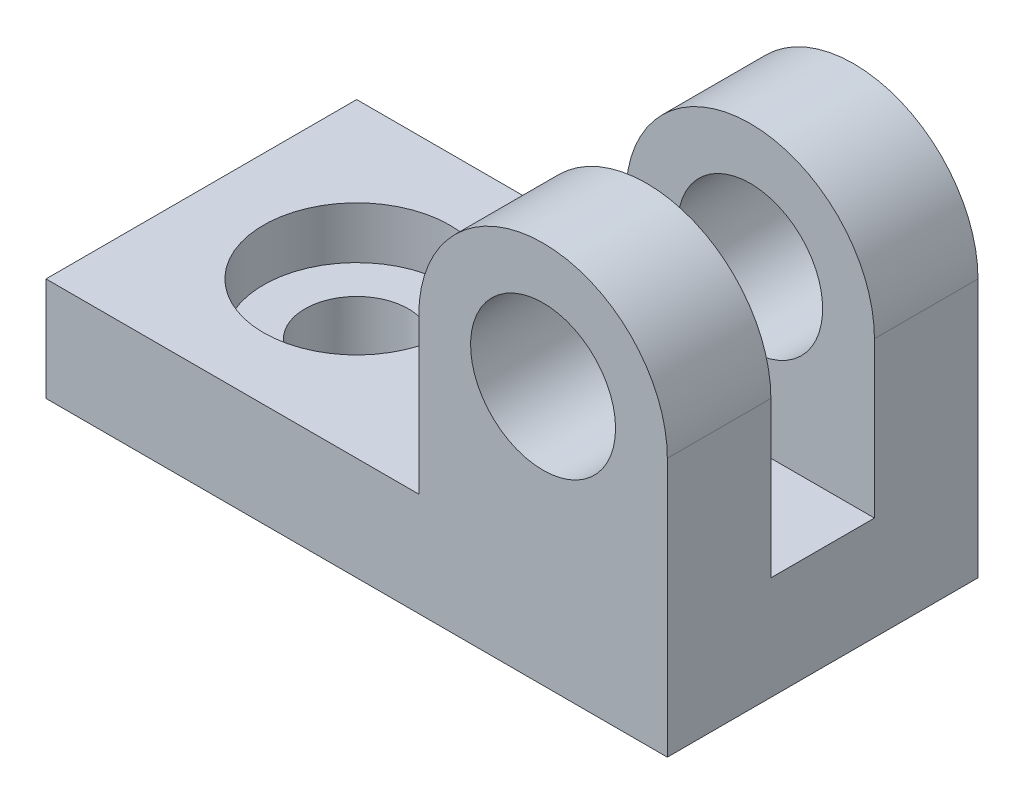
ISO-10303-21;
HEADER;
FILE_DESCRIPTION(('STEP AP214'),'2;1');
FILE_NAME('part.step','',(''),(''),'','','');
FILE_SCHEMA(('AUTOMOTIVE_DESIGN { 1 0 10303 214 1 1 1 1 }'));
ENDSEC;
DATA;
#1=APPLICATION_CONTEXT('core data for automotive mechanical design processes');
#2=APPLICATION_PROTOCOL_DEFINITION('international standard','automotive_design',2000,#1);
#3=PRODUCT_CONTEXT('',#1,'mechanical');
#4=PRODUCT('Part','Part','',(#3));
#5=PRODUCT_RELATED_PRODUCT_CATEGORY('part','',(#4));
#6=PRODUCT_DEFINITION_FORMATION('','',#4);
#7=PRODUCT_DEFINITION_CONTEXT('part definition',#1,'design');
#8=PRODUCT_DEFINITION('design','',#6,#7);
#9=PRODUCT_DEFINITION_SHAPE('','',#8);
#10=(LENGTH_UNIT() NAMED_UNIT(*) SI_UNIT(.MILLI.,.METRE.));
#11=(NAMED_UNIT(*) PLANE_ANGLE_UNIT() SI_UNIT($,.RADIAN.));
#12=(NAMED_UNIT(*) SI_UNIT($,.STERADIAN.) SOLID_ANGLE_UNIT());
#13=UNCERTAINTY_MEASURE_WITH_UNIT(LENGTH_MEASURE(1.E-05),#10,'distance_accuracy_value','');
#14=(GEOMETRIC_REPRESENTATION_CONTEXT(3) GLOBAL_UNCERTAINTY_ASSIGNED_CONTEXT((#13)) GLOBAL_UNIT_ASSIGNED_CONTEXT((#10,
#11,#12)) REPRESENTATION_CONTEXT('',''));
#15=CARTESIAN_POINT('',(0.,0.,0.));
#16=DIRECTION('',(0.,0.,1.));
#17=DIRECTION('',(1.,0.,0.));
#18=AXIS2_PLACEMENT_3D('',#15,#16,#17);
#19=CARTESIAN_POINT('',(-7.09558823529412,20.,15.));
#20=DIRECTION('',(0.,0.,-1.));
#21=DIRECTION('',(-1.,0.,0.));
#22=AXIS2_PLACEMENT_3D('',#19,#20,#21);
#23=CYLINDRICAL_SURFACE('',#22,12.);
#24=DIRECTION('',(0.,0.,-1.));
#25=VECTOR('',#24,1.);
#26=CARTESIAN_POINT('',(-19.0955882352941,20.,15.));
#27=LINE('',#26,#25);
#28=CARTESIAN_POINT('',(-19.0955882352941,20.,-5.));
#29=VERTEX_POINT('',#28);
#30=CARTESIAN_POINT('',(-19.0955882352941,20.,-15.));
#31=VERTEX_POINT('',#30);
#32=EDGE_CURVE('E158',#29,#31,#27,.T.);
#33=ORIENTED_EDGE('',*,*,#32,.F.);
#34=CARTESIAN_POINT('',(-7.09558823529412,20.,-5.));
#35=DIRECTION('',(0.,0.,-1.));
#36=DIRECTION('',(-1.,0.,0.));
#37=AXIS2_PLACEMENT_3D('',#34,#35,#36);
#38=CIRCLE('',#37,12.);
#39=CARTESIAN_POINT('',(4.90441176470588,20.,-5.));
#40=VERTEX_POINT('',#39);
#41=EDGE_CURVE('E138',#29,#40,#38,.T.);
#42=ORIENTED_EDGE('',*,*,#41,.T.);
#43=DIRECTION('',(0.,0.,-1.));
#44=VECTOR('',#43,1.);
#45=CARTESIAN_POINT('',(4.90441176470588,20.,15.));
#46=LINE('',#45,#44);
#47=CARTESIAN_POINT('',(4.90441176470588,20.,-15.));
#48=VERTEX_POINT('',#47);
#49=EDGE_CURVE('E221',#40,#48,#46,.T.);
#50=ORIENTED_EDGE('',*,*,#49,.T.);
#51=CARTESIAN_POINT('',(-7.09558823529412,20.,-15.));
#52=DIRECTION('',(0.,0.,1.));
#53=DIRECTION('',(1.,0.,0.));
#54=AXIS2_PLACEMENT_3D('',#51,#52,#53);
#55=CIRCLE('',#54,12.);
#56=EDGE_CURVE('E143',#48,#31,#55,.T.);
#57=ORIENTED_EDGE('',*,*,#56,.T.);
#58=EDGE_LOOP('',(#33,#42,#50,#57));
#59=FACE_BOUND('',#58,.T.);
#60=ADVANCED_FACE('F31',(#59),#23,.T.);
#61=CARTESIAN_POINT('',(-19.0955882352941,20.,15.));
#62=DIRECTION('',(1.,0.,0.));
#63=DIRECTION('',(0.,0.,-1.));
#64=AXIS2_PLACEMENT_3D('',#61,#62,#63);
#65=PLANE('',#64);
#66=DIRECTION('',(0.,0.,-1.));
#67=VECTOR('',#66,1.);
#68=CARTESIAN_POINT('',(-19.0955882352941,5.,15.));
#69=LINE('',#68,#67);
#70=CARTESIAN_POINT('',(-19.0955882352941,5.00000000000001,-5.));
#71=VERTEX_POINT('',#70);
#72=CARTESIAN_POINT('',(-19.0955882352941,5.,-15.));
#73=VERTEX_POINT('',#72);
#74=EDGE_CURVE('E35',#71,#73,#69,.T.);
#75=ORIENTED_EDGE('',*,*,#74,.F.);
#76=DIRECTION('',(0.,1.,0.));
#77=VECTOR('',#76,1.);
#78=CARTESIAN_POINT('',(-19.0955882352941,20.,-5.));
#79=LINE('',#78,#77);
#80=EDGE_CURVE('E172',#71,#29,#79,.T.);
#81=ORIENTED_EDGE('',*,*,#80,.T.);
#82=ORIENTED_EDGE('',*,*,#32,.T.);
#83=DIRECTION('',(0.,-1.,0.));
#84=VECTOR('',#83,1.);
#85=CARTESIAN_POINT('',(-19.0955882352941,20.,-15.));
#86=LINE('',#85,#84);
#87=EDGE_CURVE('E148',#31,#73,#86,.T.);
#88=ORIENTED_EDGE('',*,*,#87,.T.);
#89=EDGE_LOOP('',(#75,#81,#82,#88));
#90=FACE_BOUND('',#89,.T.);
#91=ADVANCED_FACE('F185',(#90),#65,.F.);
#92=CARTESIAN_POINT('',(-7.09558823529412,20.,15.));
#93=DIRECTION('',(0.,0.,-1.));
#94=DIRECTION('',(-1.,0.,0.));
#95=AXIS2_PLACEMENT_3D('',#92,#93,#94);
#96=CYLINDRICAL_SURFACE('',#95,7.);
#97=CARTESIAN_POINT('',(-7.09558823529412,20.,-5.));
#98=DIRECTION('',(0.,0.,-1.));
#99=DIRECTION('',(-1.,0.,0.));
#100=AXIS2_PLACEMENT_3D('',#97,#98,#99);
#101=CIRCLE('',#100,7.);
#102=CARTESIAN_POINT('',(-14.0955882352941,20.,-5.));
#103=VERTEX_POINT('',#102);
#104=EDGE_CURVE('E117',#103,#103,#101,.T.);
#105=ORIENTED_EDGE('',*,*,#104,.F.);
#106=EDGE_LOOP('',(#105));
#107=FACE_BOUND('',#106,.T.);
#108=CARTESIAN_POINT('',(-7.09558823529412,20.,-15.));
#109=DIRECTION('',(0.,0.,1.));
#110=DIRECTION('',(1.,0.,0.));
#111=AXIS2_PLACEMENT_3D('',#108,#109,#110);
#112=CIRCLE('',#111,7.);
#113=CARTESIAN_POINT('',(-0.0955882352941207,20.,-15.));
#114=VERTEX_POINT('',#113);
#115=EDGE_CURVE('E133',#114,#114,#112,.T.);
#116=ORIENTED_EDGE('',*,*,#115,.F.);
#117=EDGE_LOOP('',(#116));
#118=FACE_BOUND('',#117,.T.);
#119=ADVANCED_FACE('F268',(#107,#118),#96,.F.);
#120=CARTESIAN_POINT('',(-55.0955882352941,5.,15.));
#121=DIRECTION('',(0.,-1.,0.));
#122=DIRECTION('',(0.,0.,-1.));
#123=AXIS2_PLACEMENT_3D('',#120,#121,#122);
#124=PLANE('',#123);
#125=DIRECTION('',(1.,0.,0.));
#126=VECTOR('',#125,1.);
#127=CARTESIAN_POINT('',(-25.,5.00000000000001,-5.));
#128=LINE('',#127,#126);
#129=CARTESIAN_POINT('',(4.90441176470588,5.00000000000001,-5.));
#130=VERTEX_POINT('',#129);
#131=EDGE_CURVE('E127',#71,#130,#128,.T.);
#132=ORIENTED_EDGE('',*,*,#131,.F.);
#133=ORIENTED_EDGE('',*,*,#74,.T.);
#134=DIRECTION('',(-1.,0.,0.));
#135=VECTOR('',#134,1.);
#136=CARTESIAN_POINT('',(-55.0955882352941,5.,-15.));
#137=LINE('',#136,#135);
#138=CARTESIAN_POINT('',(-55.0955882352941,5.,-15.));
#139=VERTEX_POINT('',#138);
#140=EDGE_CURVE('E191',#73,#139,#137,.T.);
#141=ORIENTED_EDGE('',*,*,#140,.T.);
#142=DIRECTION('',(0.,0.,-1.));
#143=VECTOR('',#142,1.);
#144=CARTESIAN_POINT('',(-55.0955882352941,5.,15.));
#145=LINE('',#144,#143);
#146=CARTESIAN_POINT('',(-55.0955882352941,5.,15.));
#147=VERTEX_POINT('',#146);
#148=EDGE_CURVE('E212',#147,#139,#145,.T.);
#149=ORIENTED_EDGE('',*,*,#148,.F.);
#150=DIRECTION('',(-1.,0.,0.));
#151=VECTOR('',#150,1.);
#152=CARTESIAN_POINT('',(-55.0955882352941,5.,15.));
#153=LINE('',#152,#151);
#154=CARTESIAN_POINT('',(-19.0955882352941,5.,15.));
#155=VERTEX_POINT('',#154);
#156=EDGE_CURVE('E159',#155,#147,#153,.T.);
#157=ORIENTED_EDGE('',*,*,#156,.F.);
#158=CARTESIAN_POINT('',(-19.0955882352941,5.,5.));
#159=VERTEX_POINT('',#158);
#160=EDGE_CURVE('E126',#155,#159,#69,.T.);
#161=ORIENTED_EDGE('',*,*,#160,.T.);
#162=DIRECTION('',(1.,0.,0.));
#163=VECTOR('',#162,1.);
#164=CARTESIAN_POINT('',(-25.,5.00000000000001,5.));
#165=LINE('',#164,#163);
#166=CARTESIAN_POINT('',(4.90441176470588,5.00000000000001,5.));
#167=VERTEX_POINT('',#166);
#168=EDGE_CURVE('E49',#159,#167,#165,.T.);
#169=ORIENTED_EDGE('',*,*,#168,.T.);
#170=DIRECTION('',(0.,0.,1.));
#171=VECTOR('',#170,1.);
#172=CARTESIAN_POINT('',(4.90441176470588,5.00000000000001,15.));
#173=LINE('',#172,#171);
#174=EDGE_CURVE('E122',#130,#167,#173,.T.);
#175=ORIENTED_EDGE('',*,*,#174,.F.);
#176=EDGE_LOOP('',(#132,#133,#141,#149,#157,#161,#169,#175));
#177=FACE_BOUND('',#176,.T.);
#178=CARTESIAN_POINT('',(-40.0955882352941,5.,0.));
#179=DIRECTION('',(0.,-1.,0.));
#180=DIRECTION('',(0.,0.,-1.));
#181=AXIS2_PLACEMENT_3D('',#178,#179,#180);
#182=CIRCLE('',#181,9.);
#183=CARTESIAN_POINT('',(-40.0955882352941,5.,-9.));
#184=VERTEX_POINT('',#183);
#185=EDGE_CURVE('E228',#184,#184,#182,.T.);
#186=ORIENTED_EDGE('',*,*,#185,.T.);
#187=EDGE_LOOP('',(#186));
#188=FACE_BOUND('',#187,.T.);
#189=ADVANCED_FACE('F120',(#177,#188),#124,.F.);
#190=CARTESIAN_POINT('',(-40.0955882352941,-15.,0.));
#191=DIRECTION('',(0.,1.,0.));
#192=DIRECTION('',(0.,0.,1.));
#193=AXIS2_PLACEMENT_3D('',#190,#191,#192);
#194=CYLINDRICAL_SURFACE('',#193,5.);
#195=CARTESIAN_POINT('',(-40.0955882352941,-5.,0.));
#196=DIRECTION('',(0.,1.,0.));
#197=DIRECTION('',(-1.,0.,0.));
#198=AXIS2_PLACEMENT_3D('',#195,#196,#197);
#199=CIRCLE('',#198,5.);
#200=CARTESIAN_POINT('',(-45.0955882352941,-5.,0.));
#201=VERTEX_POINT('',#200);
#202=EDGE_CURVE('E231',#201,#201,#199,.T.);
#203=ORIENTED_EDGE('',*,*,#202,.F.);
#204=EDGE_LOOP('',(#203));
#205=FACE_BOUND('',#204,.T.);
#206=CARTESIAN_POINT('',(-40.0955882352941,0.,0.));
#207=DIRECTION('',(0.,1.,0.));
#208=DIRECTION('',(0.,0.,1.));
#209=AXIS2_PLACEMENT_3D('',#206,#207,#208);
#210=CIRCLE('',#209,5.);
#211=CARTESIAN_POINT('',(-40.0955882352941,0.,5.));
#212=VERTEX_POINT('',#211);
#213=EDGE_CURVE('E208',#212,#212,#210,.F.);
#214=ORIENTED_EDGE('',*,*,#213,.F.);
#215=EDGE_LOOP('',(#214));
#216=FACE_BOUND('',#215,.T.);
#217=ADVANCED_FACE('F302',(#205,#216),#194,.F.);
#218=CARTESIAN_POINT('',(-55.0955882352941,-5.,15.));
#219=DIRECTION('',(1.,0.,0.));
#220=DIRECTION('',(0.,0.,-1.));
#221=AXIS2_PLACEMENT_3D('',#218,#219,#220);
#222=PLANE('',#221);
#223=DIRECTION('',(0.,-1.,0.));
#224=VECTOR('',#223,1.);
#225=CARTESIAN_POINT('',(-55.0955882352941,-5.,-15.));
#226=LINE('',#225,#224);
#227=CARTESIAN_POINT('',(-55.0955882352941,-5.,-15.));
#228=VERTEX_POINT('',#227);
#229=EDGE_CURVE('E195',#139,#228,#226,.T.);
#230=ORIENTED_EDGE('',*,*,#229,.T.);
#231=DIRECTION('',(0.,0.,-1.));
#232=VECTOR('',#231,1.);
#233=CARTESIAN_POINT('',(-55.0955882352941,-5.,15.));
#234=LINE('',#233,#232);
#235=CARTESIAN_POINT('',(-55.0955882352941,-5.,15.));
#236=VERTEX_POINT('',#235);
#237=EDGE_CURVE('E11',#236,#228,#234,.T.);
#238=ORIENTED_EDGE('',*,*,#237,.F.);
#239=DIRECTION('',(0.,-1.,0.));
#240=VECTOR('',#239,1.);
#241=CARTESIAN_POINT('',(-55.0955882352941,-5.,15.));
#242=LINE('',#241,#240);
#243=EDGE_CURVE('E198',#147,#236,#242,.T.);
#244=ORIENTED_EDGE('',*,*,#243,.F.);
#245=ORIENTED_EDGE('',*,*,#148,.T.);
#246=EDGE_LOOP('',(#230,#238,#244,#245));
#247=FACE_BOUND('',#246,.T.);
#248=ADVANCED_FACE('F33',(#247),#222,.F.);
#249=CARTESIAN_POINT('',(4.90441176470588,-4.99999999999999,15.));
#250=DIRECTION('',(0.,1.,0.));
#251=DIRECTION('',(-1.,0.,0.));
#252=AXIS2_PLACEMENT_3D('',#249,#250,#251);
#253=PLANE('',#252);
#254=ORIENTED_EDGE('',*,*,#202,.T.);
#255=EDGE_LOOP('',(#254));
#256=FACE_BOUND('',#255,.T.);
#257=DIRECTION('',(1.,0.,0.));
#258=VECTOR('',#257,1.);
#259=CARTESIAN_POINT('',(4.90441176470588,-4.99999999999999,-15.));
#260=LINE('',#259,#258);
#261=CARTESIAN_POINT('',(4.90441176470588,-4.99999999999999,-15.));
#262=VERTEX_POINT('',#261);
#263=EDGE_CURVE('E204',#228,#262,#260,.T.);
#264=ORIENTED_EDGE('',*,*,#263,.T.);
#265=DIRECTION('',(0.,0.,-1.));
#266=VECTOR('',#265,1.);
#267=CARTESIAN_POINT('',(4.90441176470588,-4.99999999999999,15.));
#268=LINE('',#267,#266);
#269=CARTESIAN_POINT('',(4.90441176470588,-4.99999999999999,15.));
#270=VERTEX_POINT('',#269);
#271=EDGE_CURVE('E41',#270,#262,#268,.T.);
#272=ORIENTED_EDGE('',*,*,#271,.F.);
#273=DIRECTION('',(1.,0.,0.));
#274=VECTOR('',#273,1.);
#275=CARTESIAN_POINT('',(4.90441176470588,-4.99999999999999,15.));
#276=LINE('',#275,#274);
#277=EDGE_CURVE('E201',#236,#270,#276,.T.);
#278=ORIENTED_EDGE('',*,*,#277,.F.);
#279=ORIENTED_EDGE('',*,*,#237,.T.);
#280=EDGE_LOOP('',(#264,#272,#278,#279));
#281=FACE_BOUND('',#280,.T.);
#282=ADVANCED_FACE('F237',(#256,#281),#253,.F.);
#283=CARTESIAN_POINT('',(4.90441176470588,-4.99999999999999,15.));
#284=DIRECTION('',(-1.,0.,0.));
#285=DIRECTION('',(0.,0.,1.));
#286=AXIS2_PLACEMENT_3D('',#283,#284,#285);
#287=PLANE('',#286);
#288=ORIENTED_EDGE('',*,*,#49,.F.);
#289=DIRECTION('',(0.,-1.,0.));
#290=VECTOR('',#289,1.);
#291=CARTESIAN_POINT('',(4.90441176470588,-4.99999999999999,-5.));
#292=LINE('',#291,#290);
#293=EDGE_CURVE('E132',#40,#130,#292,.T.);
#294=ORIENTED_EDGE('',*,*,#293,.T.);
#295=ORIENTED_EDGE('',*,*,#174,.T.);
#296=DIRECTION('',(0.,1.,0.));
#297=VECTOR('',#296,1.);
#298=CARTESIAN_POINT('',(4.90441176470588,-4.99999999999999,5.));
#299=LINE('',#298,#297);
#300=CARTESIAN_POINT('',(4.90441176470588,20.,5.));
#301=VERTEX_POINT('',#300);
#302=EDGE_CURVE('E109',#167,#301,#299,.T.);
#303=ORIENTED_EDGE('',*,*,#302,.T.);
#304=CARTESIAN_POINT('',(4.90441176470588,20.,15.));
#305=VERTEX_POINT('',#304);
#306=EDGE_CURVE('E222',#305,#301,#46,.T.);
#307=ORIENTED_EDGE('',*,*,#306,.F.);
#308=DIRECTION('',(0.,1.,0.));
#309=VECTOR('',#308,1.);
#310=CARTESIAN_POINT('',(4.90441176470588,-4.99999999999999,15.));
#311=LINE('',#310,#309);
#312=EDGE_CURVE('E218',#270,#305,#311,.T.);
#313=ORIENTED_EDGE('',*,*,#312,.F.);
#314=ORIENTED_EDGE('',*,*,#271,.T.);
#315=DIRECTION('',(0.,1.,0.));
#316=VECTOR('',#315,1.);
#317=CARTESIAN_POINT('',(4.90441176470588,-4.99999999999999,-15.));
#318=LINE('',#317,#316);
#319=EDGE_CURVE('E199',#262,#48,#318,.T.);
#320=ORIENTED_EDGE('',*,*,#319,.T.);
#321=EDGE_LOOP('',(#288,#294,#295,#303,#307,#313,#314,#320));
#322=FACE_BOUND('',#321,.T.);
#323=ADVANCED_FACE('F131',(#322),#287,.F.);
#324=CARTESIAN_POINT('',(-55.0955882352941,5.,15.));
#325=DIRECTION('',(0.,0.,-1.));
#326=DIRECTION('',(-1.,0.,0.));
#327=AXIS2_PLACEMENT_3D('',#324,#325,#326);
#328=PLANE('',#327);
#329=ORIENTED_EDGE('',*,*,#243,.T.);
#330=ORIENTED_EDGE('',*,*,#277,.T.);
#331=ORIENTED_EDGE('',*,*,#312,.T.);
#332=CARTESIAN_POINT('',(-7.09558823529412,20.,15.));
#333=DIRECTION('',(0.,0.,1.));
#334=DIRECTION('',(1.,0.,0.));
#335=AXIS2_PLACEMENT_3D('',#332,#333,#334);
#336=CIRCLE('',#335,12.);
#337=CARTESIAN_POINT('',(-19.0955882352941,20.,15.));
#338=VERTEX_POINT('',#337);
#339=EDGE_CURVE('E145',#305,#338,#336,.T.);
#340=ORIENTED_EDGE('',*,*,#339,.T.);
#341=DIRECTION('',(0.,-1.,0.));
#342=VECTOR('',#341,1.);
#343=CARTESIAN_POINT('',(-19.0955882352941,20.,15.));
#344=LINE('',#343,#342);
#345=EDGE_CURVE('E147',#338,#155,#344,.T.);
#346=ORIENTED_EDGE('',*,*,#345,.T.);
#347=ORIENTED_EDGE('',*,*,#156,.T.);
#348=EDGE_LOOP('',(#329,#330,#331,#340,#346,#347));
#349=FACE_BOUND('',#348,.T.);
#350=CARTESIAN_POINT('',(-7.09558823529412,20.,15.));
#351=DIRECTION('',(0.,0.,1.));
#352=DIRECTION('',(1.,0.,0.));
#353=AXIS2_PLACEMENT_3D('',#350,#351,#352);
#354=CIRCLE('',#353,7.);
#355=CARTESIAN_POINT('',(-0.0955882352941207,20.,15.));
#356=VERTEX_POINT('',#355);
#357=EDGE_CURVE('E136',#356,#356,#354,.T.);
#358=ORIENTED_EDGE('',*,*,#357,.F.);
#359=EDGE_LOOP('',(#358));
#360=FACE_BOUND('',#359,.T.);
#361=ADVANCED_FACE('F242',(#349,#360),#328,.F.);
#362=CARTESIAN_POINT('',(-55.0955882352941,5.,-15.));
#363=DIRECTION('',(0.,0.,-1.));
#364=DIRECTION('',(-1.,0.,0.));
#365=AXIS2_PLACEMENT_3D('',#362,#363,#364);
#366=PLANE('',#365);
#367=ORIENTED_EDGE('',*,*,#229,.F.);
#368=ORIENTED_EDGE('',*,*,#140,.F.);
#369=ORIENTED_EDGE('',*,*,#87,.F.);
#370=ORIENTED_EDGE('',*,*,#56,.F.);
#371=ORIENTED_EDGE('',*,*,#319,.F.);
#372=ORIENTED_EDGE('',*,*,#263,.F.);
#373=EDGE_LOOP('',(#367,#368,#369,#370,#371,#372));
#374=FACE_BOUND('',#373,.T.);
#375=ORIENTED_EDGE('',*,*,#115,.T.);
#376=EDGE_LOOP('',(#375));
#377=FACE_BOUND('',#376,.T.);
#378=ADVANCED_FACE('F192',(#374,#377),#366,.T.);
#379=CARTESIAN_POINT('',(-40.0955882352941,0.,0.));
#380=DIRECTION('',(0.,1.,0.));
#381=DIRECTION('',(0.,0.,1.));
#382=AXIS2_PLACEMENT_3D('',#379,#380,#381);
#383=PLANE('',#382);
#384=CARTESIAN_POINT('',(-40.0955882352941,0.,0.));
#385=DIRECTION('',(0.,1.,0.));
#386=DIRECTION('',(0.,0.,1.));
#387=AXIS2_PLACEMENT_3D('',#384,#385,#386);
#388=CIRCLE('',#387,9.);
#389=CARTESIAN_POINT('',(-40.0955882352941,0.,-9.));
#390=VERTEX_POINT('',#389);
#391=EDGE_CURVE('E223',#390,#390,#388,.T.);
#392=ORIENTED_EDGE('',*,*,#391,.T.);
#393=EDGE_LOOP('',(#392));
#394=FACE_BOUND('',#393,.T.);
#395=ORIENTED_EDGE('',*,*,#213,.T.);
#396=EDGE_LOOP('',(#395));
#397=FACE_BOUND('',#396,.T.);
#398=ADVANCED_FACE('F260',(#394,#397),#383,.T.);
#399=CARTESIAN_POINT('',(-40.0955882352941,30.4558441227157,0.));
#400=DIRECTION('',(0.,-1.,0.));
#401=DIRECTION('',(0.,0.,-1.));
#402=AXIS2_PLACEMENT_3D('',#399,#400,#401);
#403=CYLINDRICAL_SURFACE('',#402,9.);
#404=CARTESIAN_POINT('',(-40.0955882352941,5.,-9.));
#405=CARTESIAN_POINT('',(-40.0955882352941,4.94791666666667,-9.));
#406=CARTESIAN_POINT('',(-40.0955882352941,4.89583333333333,-9.));
#407=CARTESIAN_POINT('',(-40.0955882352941,4.79166666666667,-9.));
#408=CARTESIAN_POINT('',(-40.0955882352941,4.73958333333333,-9.));
#409=CARTESIAN_POINT('',(-40.0955882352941,4.63541666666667,-9.));
#410=CARTESIAN_POINT('',(-40.0955882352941,4.58333333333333,-9.));
#411=CARTESIAN_POINT('',(-40.0955882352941,4.47916666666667,-9.));
#412=CARTESIAN_POINT('',(-40.0955882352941,4.42708333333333,-9.));
#413=CARTESIAN_POINT('',(-40.0955882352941,4.32291666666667,-9.));
#414=CARTESIAN_POINT('',(-40.0955882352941,4.27083333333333,-9.));
#415=CARTESIAN_POINT('',(-40.0955882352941,4.16666666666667,-9.));
#416=CARTESIAN_POINT('',(-40.0955882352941,4.11458333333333,-9.));
#417=CARTESIAN_POINT('',(-40.0955882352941,4.01041666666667,-9.));
#418=CARTESIAN_POINT('',(-40.0955882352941,3.95833333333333,-9.));
#419=CARTESIAN_POINT('',(-40.0955882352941,3.85416666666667,-9.));
#420=CARTESIAN_POINT('',(-40.0955882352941,3.80208333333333,-9.));
#421=CARTESIAN_POINT('',(-40.0955882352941,3.69791666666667,-9.));
#422=CARTESIAN_POINT('',(-40.0955882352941,3.64583333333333,-9.));
#423=CARTESIAN_POINT('',(-40.0955882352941,3.54166666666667,-9.));
#424=CARTESIAN_POINT('',(-40.0955882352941,3.48958333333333,-9.));
#425=CARTESIAN_POINT('',(-40.0955882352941,3.38541666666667,-9.));
#426=CARTESIAN_POINT('',(-40.0955882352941,3.33333333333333,-9.));
#427=CARTESIAN_POINT('',(-40.0955882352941,3.22916666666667,-9.));
#428=CARTESIAN_POINT('',(-40.0955882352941,3.17708333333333,-9.));
#429=CARTESIAN_POINT('',(-40.0955882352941,3.07291666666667,-9.));
#430=CARTESIAN_POINT('',(-40.0955882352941,3.02083333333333,-9.));
#431=CARTESIAN_POINT('',(-40.0955882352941,2.91666666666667,-9.));
#432=CARTESIAN_POINT('',(-40.0955882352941,2.86458333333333,-9.));
#433=CARTESIAN_POINT('',(-40.0955882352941,2.76041666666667,-9.));
#434=CARTESIAN_POINT('',(-40.0955882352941,2.70833333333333,-9.));
#435=CARTESIAN_POINT('',(-40.0955882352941,2.60416666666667,-9.));
#436=CARTESIAN_POINT('',(-40.0955882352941,2.55208333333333,-9.));
#437=CARTESIAN_POINT('',(-40.0955882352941,2.44791666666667,-9.));
#438=CARTESIAN_POINT('',(-40.0955882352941,2.39583333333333,-9.));
#439=CARTESIAN_POINT('',(-40.0955882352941,2.29166666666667,-9.));
#440=CARTESIAN_POINT('',(-40.0955882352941,2.23958333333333,-9.));
#441=CARTESIAN_POINT('',(-40.0955882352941,2.13541666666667,-9.));
#442=CARTESIAN_POINT('',(-40.0955882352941,2.08333333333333,-9.));
#443=CARTESIAN_POINT('',(-40.0955882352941,1.97916666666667,-9.));
#444=CARTESIAN_POINT('',(-40.0955882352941,1.92708333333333,-9.));
#445=CARTESIAN_POINT('',(-40.0955882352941,1.82291666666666,-9.));
#446=CARTESIAN_POINT('',(-40.0955882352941,1.77083333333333,-9.));
#447=CARTESIAN_POINT('',(-40.0955882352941,1.66666666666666,-9.));
#448=CARTESIAN_POINT('',(-40.0955882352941,1.61458333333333,-9.));
#449=CARTESIAN_POINT('',(-40.0955882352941,1.51041666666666,-9.));
#450=CARTESIAN_POINT('',(-40.0955882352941,1.45833333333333,-9.));
#451=CARTESIAN_POINT('',(-40.0955882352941,1.35416666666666,-9.));
#452=CARTESIAN_POINT('',(-40.0955882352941,1.30208333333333,-9.));
#453=CARTESIAN_POINT('',(-40.0955882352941,1.19791666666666,-9.));
#454=CARTESIAN_POINT('',(-40.0955882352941,1.14583333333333,-9.));
#455=CARTESIAN_POINT('',(-40.0955882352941,1.04166666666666,-9.));
#456=CARTESIAN_POINT('',(-40.0955882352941,0.989583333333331,-9.));
#457=CARTESIAN_POINT('',(-40.0955882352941,0.885416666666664,-9.));
#458=CARTESIAN_POINT('',(-40.0955882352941,0.833333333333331,-9.));
#459=CARTESIAN_POINT('',(-40.0955882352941,0.729166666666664,-9.));
#460=CARTESIAN_POINT('',(-40.0955882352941,0.67708333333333,-9.));
#461=CARTESIAN_POINT('',(-40.0955882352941,0.572916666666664,-9.));
#462=CARTESIAN_POINT('',(-40.0955882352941,0.52083333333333,-9.));
#463=CARTESIAN_POINT('',(-40.0955882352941,0.416666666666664,-9.));
#464=CARTESIAN_POINT('',(-40.0955882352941,0.36458333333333,-9.));
#465=CARTESIAN_POINT('',(-40.0955882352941,0.260416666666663,-9.));
#466=CARTESIAN_POINT('',(-40.0955882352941,0.20833333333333,-9.));
#467=CARTESIAN_POINT('',(-40.0955882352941,0.104166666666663,-9.));
#468=CARTESIAN_POINT('',(-40.0955882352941,0.05208333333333,-9.));
#469=CARTESIAN_POINT('',(-40.0955882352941,0.,-9.));
#470=B_SPLINE_CURVE_WITH_KNOTS('',3,(#404,#405,#406,#407,#408,#409,#410,#411,#412,#413,#414,
#415,#416,#417,#418,#419,#420,#421,#422,#423,#424,#425,#426,#427,#428,#429,#430,#431,#432,#433,
#434,#435,#436,#437,#438,#439,#440,#441,#442,#443,#444,#445,#446,#447,#448,#449,#450,#451,#452,
#453,#454,#455,#456,#457,#458,#459,#460,#461,#462,#463,#464,#465,#466,#467,#468,#469),
.UNSPECIFIED.,.F.,.F.,(4,2,2,2,2,2,2,2,2,2,2,2,2,2,2,2,2,2,2,2,2,2,2,2,2,2,2,2,2,2,2,2,4),(0.,
0.15625,0.3125,0.46875,0.625000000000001,0.781250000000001,0.937500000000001,1.09375,1.25,
1.40625,1.5625,1.71875,1.875,2.03125,2.1875,2.34375,2.5,2.65625,2.8125,2.96875,3.125,3.28125,
3.4375,3.59375,3.75,3.90625,4.0625,4.21875,4.375,4.53125,4.6875,4.84375,5.),.UNSPECIFIED.);
#471=EDGE_CURVE('BSEAM252',#184,#390,#470,.T.);
#472=ORIENTED_EDGE('',*,*,#185,.F.);
#473=ORIENTED_EDGE('',*,*,#391,.F.);
#474=ORIENTED_EDGE('',*,*,#471,.T.);
#475=ORIENTED_EDGE('',*,*,#471,.F.);
#476=EDGE_LOOP('',(#472,#474,#473,#475));
#477=FACE_BOUND('',#476,.T.);
#478=ADVANCED_FACE('F252',(#477),#403,.F.);
#479=ORIENTED_EDGE('',*,*,#306,.T.);
#480=CARTESIAN_POINT('',(-7.09558823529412,20.,5.));
#481=DIRECTION('',(0.,0.,1.));
#482=DIRECTION('',(0.,-1.,0.));
#483=AXIS2_PLACEMENT_3D('',#480,#481,#482);
#484=CIRCLE('',#483,12.);
#485=CARTESIAN_POINT('',(-19.0955882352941,20.,5.));
#486=VERTEX_POINT('',#485);
#487=EDGE_CURVE('E112',#301,#486,#484,.T.);
#488=ORIENTED_EDGE('',*,*,#487,.T.);
#489=EDGE_CURVE('E152',#338,#486,#27,.T.);
#490=ORIENTED_EDGE('',*,*,#489,.F.);
#491=ORIENTED_EDGE('',*,*,#339,.F.);
#492=EDGE_LOOP('',(#479,#488,#490,#491));
#493=FACE_BOUND('',#492,.T.);
#494=ADVANCED_FACE('F250',(#493),#23,.T.);
#495=ORIENTED_EDGE('',*,*,#489,.T.);
#496=DIRECTION('',(0.,-1.,0.));
#497=VECTOR('',#496,1.);
#498=CARTESIAN_POINT('',(-19.0955882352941,20.,5.));
#499=LINE('',#498,#497);
#500=EDGE_CURVE('E170',#486,#159,#499,.T.);
#501=ORIENTED_EDGE('',*,*,#500,.T.);
#502=ORIENTED_EDGE('',*,*,#160,.F.);
#503=ORIENTED_EDGE('',*,*,#345,.F.);
#504=EDGE_LOOP('',(#495,#501,#502,#503));
#505=FACE_BOUND('',#504,.T.);
#506=ADVANCED_FACE('F248',(#505),#65,.F.);
#507=CARTESIAN_POINT('',(-7.09558823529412,20.,5.));
#508=DIRECTION('',(0.,0.,1.));
#509=DIRECTION('',(0.,-1.,0.));
#510=AXIS2_PLACEMENT_3D('',#507,#508,#509);
#511=CIRCLE('',#510,7.);
#512=CARTESIAN_POINT('',(-7.09558823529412,13.,5.));
#513=VERTEX_POINT('',#512);
#514=EDGE_CURVE('E168',#513,#513,#511,.T.);
#515=ORIENTED_EDGE('',*,*,#514,.F.);
#516=EDGE_LOOP('',(#515));
#517=FACE_BOUND('',#516,.T.);
#518=ORIENTED_EDGE('',*,*,#357,.T.);
#519=EDGE_LOOP('',(#518));
#520=FACE_BOUND('',#519,.T.);
#521=ADVANCED_FACE('F258',(#517,#520),#96,.F.);
#522=CARTESIAN_POINT('',(-25.,5.00000000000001,-5.));
#523=DIRECTION('',(0.,0.,-1.));
#524=DIRECTION('',(-1.,0.,0.));
#525=AXIS2_PLACEMENT_3D('',#522,#523,#524);
#526=PLANE('',#525);
#527=ORIENTED_EDGE('',*,*,#104,.T.);
#528=EDGE_LOOP('',(#527));
#529=FACE_BOUND('',#528,.T.);
#530=ORIENTED_EDGE('',*,*,#41,.F.);
#531=ORIENTED_EDGE('',*,*,#80,.F.);
#532=ORIENTED_EDGE('',*,*,#131,.T.);
#533=ORIENTED_EDGE('',*,*,#293,.F.);
#534=EDGE_LOOP('',(#530,#531,#532,#533));
#535=FACE_BOUND('',#534,.T.);
#536=ADVANCED_FACE('F184',(#529,#535),#526,.F.);
#537=CARTESIAN_POINT('',(-25.,35.2587790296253,5.));
#538=DIRECTION('',(0.,0.,1.));
#539=DIRECTION('',(0.,-1.,0.));
#540=AXIS2_PLACEMENT_3D('',#537,#538,#539);
#541=PLANE('',#540);
#542=ORIENTED_EDGE('',*,*,#514,.T.);
#543=EDGE_LOOP('',(#542));
#544=FACE_BOUND('',#543,.T.);
#545=ORIENTED_EDGE('',*,*,#168,.F.);
#546=ORIENTED_EDGE('',*,*,#500,.F.);
#547=ORIENTED_EDGE('',*,*,#487,.F.);
#548=ORIENTED_EDGE('',*,*,#302,.F.);
#549=EDGE_LOOP('',(#545,#546,#547,#548));
#550=FACE_BOUND('',#549,.T.);
#551=ADVANCED_FACE('F110',(#544,#550),#541,.F.);
#552=CLOSED_SHELL('',(#60,#91,#119,#189,#217,#248,#282,#323,#361,#378,#398,#478,#494,#506,#521,
#536,#551));
#553=MANIFOLD_SOLID_BREP('B2',#552);
#554=ADVANCED_BREP_SHAPE_REPRESENTATION('',(#18,#553),#14);
#555=SHAPE_DEFINITION_REPRESENTATION(#9,#554);
ENDSEC;
END-ISO-10303-21;
